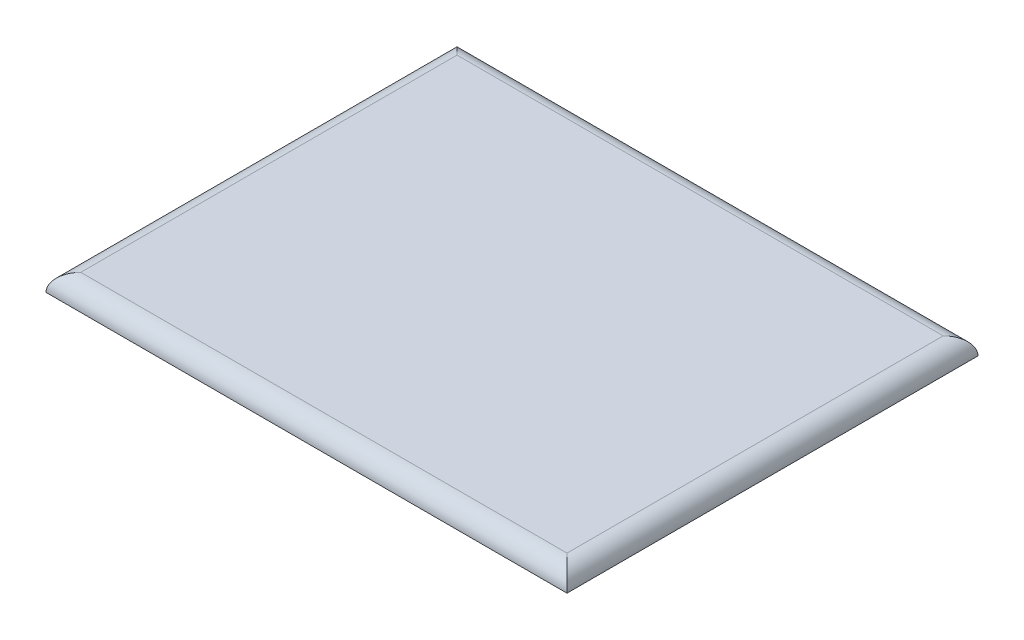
ISO-10303-21;
HEADER;
FILE_DESCRIPTION(('STEP AP214'),'2;1');
FILE_NAME('part.step','',(''),(''),'','','');
FILE_SCHEMA(('AUTOMOTIVE_DESIGN { 1 0 10303 214 1 1 1 1 }'));
ENDSEC;
DATA;
#1=APPLICATION_CONTEXT('core data for automotive mechanical design processes');
#2=APPLICATION_PROTOCOL_DEFINITION('international standard','automotive_design',2000,#1);
#3=PRODUCT_CONTEXT('',#1,'mechanical');
#4=PRODUCT('Part','Part','',(#3));
#5=PRODUCT_RELATED_PRODUCT_CATEGORY('part','',(#4));
#6=PRODUCT_DEFINITION_FORMATION('','',#4);
#7=PRODUCT_DEFINITION_CONTEXT('part definition',#1,'design');
#8=PRODUCT_DEFINITION('design','',#6,#7);
#9=PRODUCT_DEFINITION_SHAPE('','',#8);
#10=(LENGTH_UNIT() NAMED_UNIT(*) SI_UNIT(.MILLI.,.METRE.));
#11=(NAMED_UNIT(*) PLANE_ANGLE_UNIT() SI_UNIT($,.RADIAN.));
#12=(NAMED_UNIT(*) SI_UNIT($,.STERADIAN.) SOLID_ANGLE_UNIT());
#13=UNCERTAINTY_MEASURE_WITH_UNIT(LENGTH_MEASURE(1.E-05),#10,'distance_accuracy_value','');
#14=(GEOMETRIC_REPRESENTATION_CONTEXT(3) GLOBAL_UNCERTAINTY_ASSIGNED_CONTEXT((#13)) GLOBAL_UNIT_ASSIGNED_CONTEXT((#10,
#11,#12)) REPRESENTATION_CONTEXT('',''));
#15=CARTESIAN_POINT('',(0.,0.,0.));
#16=DIRECTION('',(0.,0.,1.));
#17=DIRECTION('',(1.,0.,0.));
#18=AXIS2_PLACEMENT_3D('',#15,#16,#17);
#19=CARTESIAN_POINT('',(0.,3.,0.));
#20=DIRECTION('',(0.,1.,0.));
#21=DIRECTION('',(0.,0.,1.));
#22=AXIS2_PLACEMENT_3D('',#19,#20,#21);
#23=PLANE('',#22);
#24=DIRECTION('',(0.,0.,-1.));
#25=VECTOR('',#24,1.);
#26=CARTESIAN_POINT('',(32.2165670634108,3.,-37.8188671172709));
#27=LINE('',#26,#25);
#28=CARTESIAN_POINT('',(32.2165670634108,3.,30.1811328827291));
#29=VERTEX_POINT('',#28);
#30=CARTESIAN_POINT('',(32.2165670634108,3.,-34.8188671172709));
#31=VERTEX_POINT('',#30);
#32=EDGE_CURVE('E42',#29,#31,#27,.T.);
#33=ORIENTED_EDGE('',*,*,#32,.T.);
#34=DIRECTION('',(-1.,0.,0.));
#35=VECTOR('',#34,1.);
#36=CARTESIAN_POINT('',(-54.7834329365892,3.,-34.8188671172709));
#37=LINE('',#36,#35);
#38=CARTESIAN_POINT('',(-51.7834329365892,3.,-34.8188671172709));
#39=VERTEX_POINT('',#38);
#40=EDGE_CURVE('E11',#31,#39,#37,.T.);
#41=ORIENTED_EDGE('',*,*,#40,.T.);
#42=DIRECTION('',(0.,0.,1.));
#43=VECTOR('',#42,1.);
#44=CARTESIAN_POINT('',(-51.7834329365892,3.,33.1811328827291));
#45=LINE('',#44,#43);
#46=CARTESIAN_POINT('',(-51.7834329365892,3.,30.1811328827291));
#47=VERTEX_POINT('',#46);
#48=EDGE_CURVE('E98',#39,#47,#45,.T.);
#49=ORIENTED_EDGE('',*,*,#48,.T.);
#50=DIRECTION('',(1.,0.,0.));
#51=VECTOR('',#50,1.);
#52=CARTESIAN_POINT('',(35.2165670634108,3.,30.1811328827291));
#53=LINE('',#52,#51);
#54=EDGE_CURVE('E53',#47,#29,#53,.T.);
#55=ORIENTED_EDGE('',*,*,#54,.T.);
#56=EDGE_LOOP('',(#33,#41,#49,#55));
#57=FACE_BOUND('',#56,.T.);
#58=ADVANCED_FACE('F33',(#57),#23,.T.);
#59=CARTESIAN_POINT('',(0.,0.,0.));
#60=DIRECTION('',(0.,1.,0.));
#61=DIRECTION('',(0.,0.,1.));
#62=AXIS2_PLACEMENT_3D('',#59,#60,#61);
#63=PLANE('',#62);
#64=DIRECTION('',(0.,0.,1.));
#65=VECTOR('',#64,1.);
#66=CARTESIAN_POINT('',(-54.7834329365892,0.,-37.8188671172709));
#67=LINE('',#66,#65);
#68=CARTESIAN_POINT('',(-54.7834329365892,0.,-37.8188671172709));
#69=VERTEX_POINT('',#68);
#70=CARTESIAN_POINT('',(-54.7834329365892,0.,33.1811328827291));
#71=VERTEX_POINT('',#70);
#72=EDGE_CURVE('E78',#69,#71,#67,.T.);
#73=ORIENTED_EDGE('',*,*,#72,.F.);
#74=DIRECTION('',(-1.,0.,0.));
#75=VECTOR('',#74,1.);
#76=CARTESIAN_POINT('',(-54.7834329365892,0.,-37.8188671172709));
#77=LINE('',#76,#75);
#78=CARTESIAN_POINT('',(35.2165670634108,0.,-37.8188671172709));
#79=VERTEX_POINT('',#78);
#80=EDGE_CURVE('E96',#79,#69,#77,.T.);
#81=ORIENTED_EDGE('',*,*,#80,.F.);
#82=DIRECTION('',(0.,0.,-1.));
#83=VECTOR('',#82,1.);
#84=CARTESIAN_POINT('',(35.2165670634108,0.,-37.8188671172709));
#85=LINE('',#84,#83);
#86=CARTESIAN_POINT('',(35.2165670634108,0.,33.1811328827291));
#87=VERTEX_POINT('',#86);
#88=EDGE_CURVE('E81',#87,#79,#85,.T.);
#89=ORIENTED_EDGE('',*,*,#88,.F.);
#90=DIRECTION('',(1.,0.,0.));
#91=VECTOR('',#90,1.);
#92=CARTESIAN_POINT('',(-54.7834329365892,0.,33.1811328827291));
#93=LINE('',#92,#91);
#94=EDGE_CURVE('E73',#71,#87,#93,.T.);
#95=ORIENTED_EDGE('',*,*,#94,.F.);
#96=EDGE_LOOP('',(#73,#81,#89,#95));
#97=FACE_BOUND('',#96,.T.);
#98=ADVANCED_FACE('F75',(#97),#63,.F.);
#99=CARTESIAN_POINT('',(0.,0.,30.1811328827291));
#100=DIRECTION('',(-1.,0.,0.));
#101=DIRECTION('',(0.,0.,1.));
#102=AXIS2_PLACEMENT_3D('',#99,#100,#101);
#103=CYLINDRICAL_SURFACE('',#102,3.);
#104=CARTESIAN_POINT('',(-51.7834329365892,0.,30.1811328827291));
#105=DIRECTION('',(-0.707106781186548,0.,-0.707106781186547));
#106=DIRECTION('',(0.707106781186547,0.,-0.707106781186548));
#107=AXIS2_PLACEMENT_3D('',#104,#105,#106);
#108=ELLIPSE('',#107,4.24264068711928,3.);
#109=EDGE_CURVE('E86',#71,#47,#108,.T.);
#110=ORIENTED_EDGE('',*,*,#109,.F.);
#111=ORIENTED_EDGE('',*,*,#94,.T.);
#112=CARTESIAN_POINT('',(32.2165670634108,0.,30.1811328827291));
#113=DIRECTION('',(-0.707106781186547,0.,0.707106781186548));
#114=DIRECTION('',(-0.707106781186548,0.,-0.707106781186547));
#115=AXIS2_PLACEMENT_3D('',#112,#113,#114);
#116=ELLIPSE('',#115,4.24264068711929,3.);
#117=EDGE_CURVE('E37',#29,#87,#116,.F.);
#118=ORIENTED_EDGE('',*,*,#117,.F.);
#119=ORIENTED_EDGE('',*,*,#54,.F.);
#120=EDGE_LOOP('',(#110,#111,#118,#119));
#121=FACE_BOUND('',#120,.T.);
#122=ADVANCED_FACE('F35',(#121),#103,.T.);
#123=CARTESIAN_POINT('',(32.2165670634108,0.,0.));
#124=DIRECTION('',(0.,0.,1.));
#125=DIRECTION('',(1.,0.,0.));
#126=AXIS2_PLACEMENT_3D('',#123,#124,#125);
#127=CYLINDRICAL_SURFACE('',#126,3.);
#128=ORIENTED_EDGE('',*,*,#117,.T.);
#129=ORIENTED_EDGE('',*,*,#88,.T.);
#130=CARTESIAN_POINT('',(32.2165670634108,0.,-34.8188671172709));
#131=DIRECTION('',(0.707106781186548,0.,0.707106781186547));
#132=DIRECTION('',(-0.707106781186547,0.,0.707106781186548));
#133=AXIS2_PLACEMENT_3D('',#130,#131,#132);
#134=ELLIPSE('',#133,4.24264068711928,3.);
#135=EDGE_CURVE('E89',#31,#79,#134,.F.);
#136=ORIENTED_EDGE('',*,*,#135,.F.);
#137=ORIENTED_EDGE('',*,*,#32,.F.);
#138=EDGE_LOOP('',(#128,#129,#136,#137));
#139=FACE_BOUND('',#138,.T.);
#140=ADVANCED_FACE('F107',(#139),#127,.T.);
#141=CARTESIAN_POINT('',(-51.7834329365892,0.,0.));
#142=DIRECTION('',(0.,0.,-1.));
#143=DIRECTION('',(-1.,0.,0.));
#144=AXIS2_PLACEMENT_3D('',#141,#142,#143);
#145=CYLINDRICAL_SURFACE('',#144,3.);
#146=ORIENTED_EDGE('',*,*,#109,.T.);
#147=ORIENTED_EDGE('',*,*,#48,.F.);
#148=CARTESIAN_POINT('',(-51.7834329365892,0.,-34.8188671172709));
#149=DIRECTION('',(0.707106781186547,0.,-0.707106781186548));
#150=DIRECTION('',(-0.707106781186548,0.,-0.707106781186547));
#151=AXIS2_PLACEMENT_3D('',#148,#149,#150);
#152=ELLIPSE('',#151,4.24264068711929,3.);
#153=EDGE_CURVE('E92',#69,#39,#152,.T.);
#154=ORIENTED_EDGE('',*,*,#153,.F.);
#155=ORIENTED_EDGE('',*,*,#72,.T.);
#156=EDGE_LOOP('',(#146,#147,#154,#155));
#157=FACE_BOUND('',#156,.T.);
#158=ADVANCED_FACE('F91',(#157),#145,.T.);
#159=CARTESIAN_POINT('',(0.,0.,-34.8188671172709));
#160=DIRECTION('',(1.,0.,0.));
#161=DIRECTION('',(0.,0.,-1.));
#162=AXIS2_PLACEMENT_3D('',#159,#160,#161);
#163=CYLINDRICAL_SURFACE('',#162,3.);
#164=ORIENTED_EDGE('',*,*,#135,.T.);
#165=ORIENTED_EDGE('',*,*,#80,.T.);
#166=ORIENTED_EDGE('',*,*,#153,.T.);
#167=ORIENTED_EDGE('',*,*,#40,.F.);
#168=EDGE_LOOP('',(#164,#165,#166,#167));
#169=FACE_BOUND('',#168,.T.);
#170=ADVANCED_FACE('F105',(#169),#163,.T.);
#171=CLOSED_SHELL('',(#58,#98,#122,#140,#158,#170));
#172=MANIFOLD_SOLID_BREP('B2',#171);
#173=ADVANCED_BREP_SHAPE_REPRESENTATION('',(#18,#172),#14);
#174=SHAPE_DEFINITION_REPRESENTATION(#9,#173);
ENDSEC;
END-ISO-10303-21;
